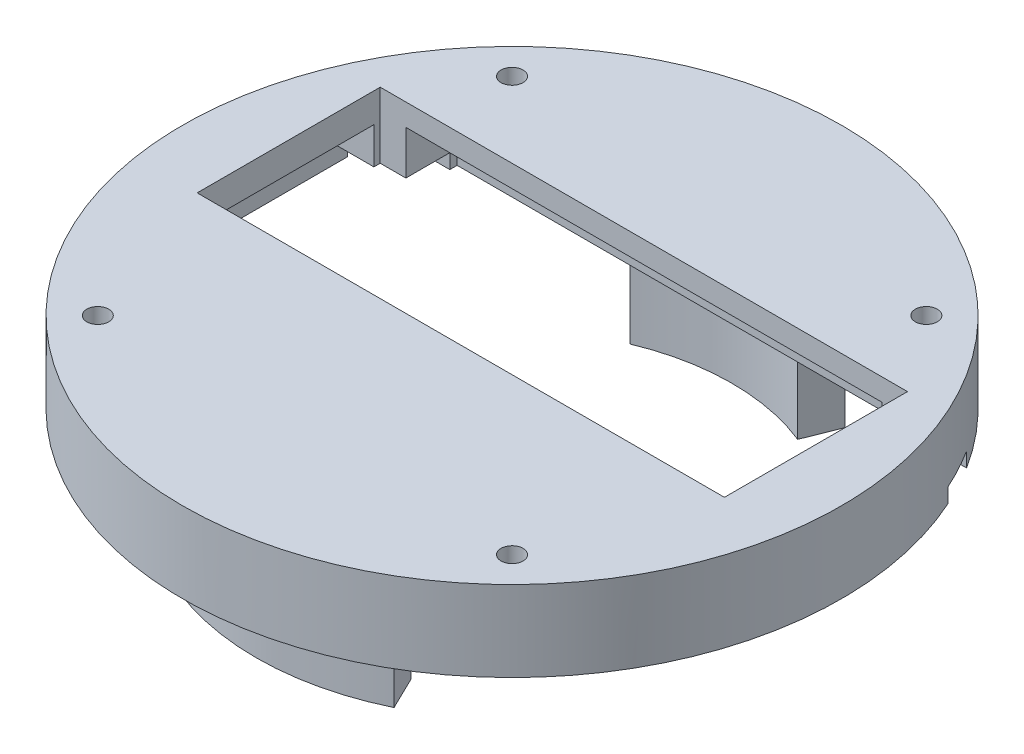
ISO-10303-21;
HEADER;
FILE_DESCRIPTION(('STEP AP214'),'2;1');
FILE_NAME('part.step','',(''),(''),'','','');
FILE_SCHEMA(('AUTOMOTIVE_DESIGN { 1 0 10303 214 1 1 1 1 }'));
ENDSEC;
DATA;
#1=APPLICATION_CONTEXT('core data for automotive mechanical design processes');
#2=APPLICATION_PROTOCOL_DEFINITION('international standard','automotive_design',2000,#1);
#3=PRODUCT_CONTEXT('',#1,'mechanical');
#4=PRODUCT('Part','Part','',(#3));
#5=PRODUCT_RELATED_PRODUCT_CATEGORY('part','',(#4));
#6=PRODUCT_DEFINITION_FORMATION('','',#4);
#7=PRODUCT_DEFINITION_CONTEXT('part definition',#1,'design');
#8=PRODUCT_DEFINITION('design','',#6,#7);
#9=PRODUCT_DEFINITION_SHAPE('','',#8);
#10=(LENGTH_UNIT() NAMED_UNIT(*) SI_UNIT(.MILLI.,.METRE.));
#11=(NAMED_UNIT(*) PLANE_ANGLE_UNIT() SI_UNIT($,.RADIAN.));
#12=(NAMED_UNIT(*) SI_UNIT($,.STERADIAN.) SOLID_ANGLE_UNIT());
#13=UNCERTAINTY_MEASURE_WITH_UNIT(LENGTH_MEASURE(1.E-05),#10,'distance_accuracy_value','');
#14=(GEOMETRIC_REPRESENTATION_CONTEXT(3) GLOBAL_UNCERTAINTY_ASSIGNED_CONTEXT((#13)) GLOBAL_UNIT_ASSIGNED_CONTEXT((#10,
#11,#12)) REPRESENTATION_CONTEXT('',''));
#15=CARTESIAN_POINT('',(0.,0.,0.));
#16=DIRECTION('',(0.,0.,1.));
#17=DIRECTION('',(1.,0.,0.));
#18=AXIS2_PLACEMENT_3D('',#15,#16,#17);
#19=CARTESIAN_POINT('',(-38.0657326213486,2.,-24.));
#20=DIRECTION('',(0.,0.,-1.));
#21=DIRECTION('',(-1.,0.,0.));
#22=AXIS2_PLACEMENT_3D('',#19,#20,#21);
#23=PLANE('',#22);
#24=DIRECTION('',(1.,0.,0.));
#25=VECTOR('',#24,1.);
#26=CARTESIAN_POINT('',(-38.0657326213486,0.,-24.));
#27=LINE('',#26,#25);
#28=CARTESIAN_POINT('',(-38.0657326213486,0.,-24.));
#29=VERTEX_POINT('',#28);
#30=CARTESIAN_POINT('',(-32.5,0.,-24.));
#31=VERTEX_POINT('',#30);
#32=EDGE_CURVE('E513',#29,#31,#27,.T.);
#33=ORIENTED_EDGE('',*,*,#32,.T.);
#34=DIRECTION('',(0.,1.,0.));
#35=VECTOR('',#34,1.);
#36=CARTESIAN_POINT('',(-32.5,2.,-24.));
#37=LINE('',#36,#35);
#38=CARTESIAN_POINT('',(-32.5,2.,-24.));
#39=VERTEX_POINT('',#38);
#40=EDGE_CURVE('E325',#31,#39,#37,.T.);
#41=ORIENTED_EDGE('',*,*,#40,.T.);
#42=DIRECTION('',(1.,0.,0.));
#43=VECTOR('',#42,1.);
#44=CARTESIAN_POINT('',(-38.0657326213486,2.,-24.));
#45=LINE('',#44,#43);
#46=CARTESIAN_POINT('',(-38.0657326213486,2.,-24.));
#47=VERTEX_POINT('',#46);
#48=EDGE_CURVE('E525',#47,#39,#45,.T.);
#49=ORIENTED_EDGE('',*,*,#48,.F.);
#50=DIRECTION('',(0.,-1.,0.));
#51=VECTOR('',#50,1.);
#52=CARTESIAN_POINT('',(-38.0657326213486,2.,-24.));
#53=LINE('',#52,#51);
#54=EDGE_CURVE('E548',#47,#29,#53,.T.);
#55=ORIENTED_EDGE('',*,*,#54,.T.);
#56=EDGE_LOOP('',(#33,#41,#49,#55));
#57=FACE_BOUND('',#56,.T.);
#58=ADVANCED_FACE('F34',(#57),#23,.F.);
#59=CARTESIAN_POINT('',(-41.,2.,13.));
#60=DIRECTION('',(0.,0.,1.));
#61=DIRECTION('',(1.,0.,0.));
#62=AXIS2_PLACEMENT_3D('',#59,#60,#61);
#63=PLANE('',#62);
#64=DIRECTION('',(-1.,0.,0.));
#65=VECTOR('',#64,1.);
#66=CARTESIAN_POINT('',(-41.,2.,13.));
#67=LINE('',#66,#65);
#68=CARTESIAN_POINT('',(-32.5,2.,13.));
#69=VERTEX_POINT('',#68);
#70=CARTESIAN_POINT('',(-41.,2.,13.));
#71=VERTEX_POINT('',#70);
#72=EDGE_CURVE('E512',#69,#71,#67,.T.);
#73=ORIENTED_EDGE('',*,*,#72,.F.);
#74=DIRECTION('',(0.,-1.,0.));
#75=VECTOR('',#74,1.);
#76=CARTESIAN_POINT('',(-32.5,2.,13.));
#77=LINE('',#76,#75);
#78=CARTESIAN_POINT('',(-32.5,0.,13.));
#79=VERTEX_POINT('',#78);
#80=EDGE_CURVE('E332',#69,#79,#77,.T.);
#81=ORIENTED_EDGE('',*,*,#80,.T.);
#82=DIRECTION('',(-1.,0.,0.));
#83=VECTOR('',#82,1.);
#84=CARTESIAN_POINT('',(-41.,0.,13.));
#85=LINE('',#84,#83);
#86=CARTESIAN_POINT('',(-41.,0.,13.));
#87=VERTEX_POINT('',#86);
#88=EDGE_CURVE('E533',#79,#87,#85,.T.);
#89=ORIENTED_EDGE('',*,*,#88,.T.);
#90=DIRECTION('',(0.,-1.,0.));
#91=VECTOR('',#90,1.);
#92=CARTESIAN_POINT('',(-41.,2.,13.));
#93=LINE('',#92,#91);
#94=EDGE_CURVE('E553',#71,#87,#93,.T.);
#95=ORIENTED_EDGE('',*,*,#94,.F.);
#96=EDGE_LOOP('',(#73,#81,#89,#95));
#97=FACE_BOUND('',#96,.T.);
#98=ADVANCED_FACE('F679',(#97),#63,.F.);
#99=CARTESIAN_POINT('',(0.,2.,0.));
#100=DIRECTION('',(0.,-1.,0.));
#101=DIRECTION('',(0.,0.,-1.));
#102=AXIS2_PLACEMENT_3D('',#99,#100,#101);
#103=PLANE('',#102);
#104=DIRECTION('',(0.,0.,-1.));
#105=VECTOR('',#104,1.);
#106=CARTESIAN_POINT('',(-32.5,2.,0.));
#107=LINE('',#106,#105);
#108=CARTESIAN_POINT('',(-32.5,2.,-18.));
#109=VERTEX_POINT('',#108);
#110=EDGE_CURVE('E323',#109,#39,#107,.T.);
#111=ORIENTED_EDGE('',*,*,#110,.F.);
#112=DIRECTION('',(1.,0.,0.));
#113=VECTOR('',#112,1.);
#114=CARTESIAN_POINT('',(36.,2.,-18.));
#115=LINE('',#114,#113);
#116=CARTESIAN_POINT('',(-36.,2.,-18.));
#117=VERTEX_POINT('',#116);
#118=EDGE_CURVE('E491',#117,#109,#115,.T.);
#119=ORIENTED_EDGE('',*,*,#118,.F.);
#120=DIRECTION('',(0.,0.,-1.));
#121=VECTOR('',#120,1.);
#122=CARTESIAN_POINT('',(-36.,2.,-18.));
#123=LINE('',#122,#121);
#124=CARTESIAN_POINT('',(-36.,2.,-17.1380929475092));
#125=VERTEX_POINT('',#124);
#126=EDGE_CURVE('E474',#125,#117,#123,.T.);
#127=ORIENTED_EDGE('',*,*,#126,.F.);
#128=DIRECTION('',(1.,0.,0.));
#129=VECTOR('',#128,1.);
#130=CARTESIAN_POINT('',(-36.,2.,-17.1380929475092));
#131=LINE('',#130,#129);
#132=CARTESIAN_POINT('',(-41.,2.,-17.1380929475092));
#133=VERTEX_POINT('',#132);
#134=EDGE_CURVE('E439',#133,#125,#131,.T.);
#135=ORIENTED_EDGE('',*,*,#134,.F.);
#136=DIRECTION('',(0.,0.,-1.));
#137=VECTOR('',#136,1.);
#138=CARTESIAN_POINT('',(-41.,2.,-18.5472369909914));
#139=LINE('',#138,#137);
#140=CARTESIAN_POINT('',(-41.,2.,-18.5472369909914));
#141=VERTEX_POINT('',#140);
#142=EDGE_CURVE('E517',#133,#141,#139,.T.);
#143=ORIENTED_EDGE('',*,*,#142,.T.);
#144=CARTESIAN_POINT('',(0.,2.,0.));
#145=DIRECTION('',(0.,-1.,0.));
#146=DIRECTION('',(0.,0.,-1.));
#147=AXIS2_PLACEMENT_3D('',#144,#145,#146);
#148=CIRCLE('',#147,45.);
#149=EDGE_CURVE('E521',#141,#47,#148,.T.);
#150=ORIENTED_EDGE('',*,*,#149,.T.);
#151=ORIENTED_EDGE('',*,*,#48,.T.);
#152=EDGE_LOOP('',(#111,#119,#127,#135,#143,#150,#151));
#153=FACE_BOUND('',#152,.T.);
#154=ADVANCED_FACE('F645',(#153),#103,.T.);
#155=CARTESIAN_POINT('',(-32.5,2.,6.99999999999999));
#156=VERTEX_POINT('',#155);
#157=EDGE_CURVE('E326',#69,#156,#107,.T.);
#158=ORIENTED_EDGE('',*,*,#157,.F.);
#159=ORIENTED_EDGE('',*,*,#72,.T.);
#160=CARTESIAN_POINT('',(-41.,2.,6.99999999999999));
#161=VERTEX_POINT('',#160);
#162=EDGE_CURVE('E518',#71,#161,#139,.T.);
#163=ORIENTED_EDGE('',*,*,#162,.T.);
#164=DIRECTION('',(-1.,0.,0.));
#165=VECTOR('',#164,1.);
#166=CARTESIAN_POINT('',(36.,2.,7.00000000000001));
#167=LINE('',#166,#165);
#168=EDGE_CURVE('E479',#156,#161,#167,.T.);
#169=ORIENTED_EDGE('',*,*,#168,.F.);
#170=EDGE_LOOP('',(#158,#159,#163,#169));
#171=FACE_BOUND('',#170,.T.);
#172=ADVANCED_FACE('F629',(#171),#103,.T.);
#173=CARTESIAN_POINT('',(-28.2842712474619,0.,-28.2842712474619));
#174=DIRECTION('',(0.,1.,0.));
#175=DIRECTION('',(0.,0.,1.));
#176=AXIS2_PLACEMENT_3D('',#173,#174,#175);
#177=CYLINDRICAL_SURFACE('',#176,1.5);
#178=CARTESIAN_POINT('',(-28.2842712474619,11.,-28.2842712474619));
#179=DIRECTION('',(0.,1.,0.));
#180=DIRECTION('',(0.,0.,1.));
#181=AXIS2_PLACEMENT_3D('',#178,#179,#180);
#182=CIRCLE('',#181,1.5);
#183=CARTESIAN_POINT('',(-28.2842712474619,11.,-26.7842712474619));
#184=VERTEX_POINT('',#183);
#185=EDGE_CURVE('E365',#184,#184,#182,.T.);
#186=ORIENTED_EDGE('',*,*,#185,.T.);
#187=EDGE_LOOP('',(#186));
#188=FACE_BOUND('',#187,.T.);
#189=CARTESIAN_POINT('',(-28.2842712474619,4.,-28.2842712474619));
#190=DIRECTION('',(0.,-1.,0.));
#191=DIRECTION('',(0.,0.,-1.));
#192=AXIS2_PLACEMENT_3D('',#189,#190,#191);
#193=CIRCLE('',#192,1.5);
#194=CARTESIAN_POINT('',(-28.2842712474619,4.,-29.7842712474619));
#195=VERTEX_POINT('',#194);
#196=EDGE_CURVE('E361',#195,#195,#193,.F.);
#197=ORIENTED_EDGE('',*,*,#196,.F.);
#198=EDGE_LOOP('',(#197));
#199=FACE_BOUND('',#198,.T.);
#200=ADVANCED_FACE('F740',(#188,#199),#177,.F.);
#201=CARTESIAN_POINT('',(28.2842712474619,0.,28.2842712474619));
#202=DIRECTION('',(0.,1.,0.));
#203=DIRECTION('',(0.,0.,1.));
#204=AXIS2_PLACEMENT_3D('',#201,#202,#203);
#205=CYLINDRICAL_SURFACE('',#204,1.5);
#206=CARTESIAN_POINT('',(28.2842712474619,11.,28.2842712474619));
#207=DIRECTION('',(0.,1.,0.));
#208=DIRECTION('',(0.,0.,1.));
#209=AXIS2_PLACEMENT_3D('',#206,#207,#208);
#210=CIRCLE('',#209,1.5);
#211=CARTESIAN_POINT('',(28.2842712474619,11.,29.7842712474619));
#212=VERTEX_POINT('',#211);
#213=EDGE_CURVE('E366',#212,#212,#210,.T.);
#214=ORIENTED_EDGE('',*,*,#213,.T.);
#215=EDGE_LOOP('',(#214));
#216=FACE_BOUND('',#215,.T.);
#217=CARTESIAN_POINT('',(28.2842712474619,4.,28.2842712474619));
#218=DIRECTION('',(0.,-1.,0.));
#219=DIRECTION('',(0.,0.,-1.));
#220=AXIS2_PLACEMENT_3D('',#217,#218,#219);
#221=CIRCLE('',#220,1.5);
#222=CARTESIAN_POINT('',(28.2842712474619,4.,26.7842712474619));
#223=VERTEX_POINT('',#222);
#224=EDGE_CURVE('E569',#223,#223,#221,.F.);
#225=ORIENTED_EDGE('',*,*,#224,.F.);
#226=EDGE_LOOP('',(#225));
#227=FACE_BOUND('',#226,.T.);
#228=ADVANCED_FACE('F737',(#216,#227),#205,.F.);
#229=CARTESIAN_POINT('',(28.2842712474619,0.,-28.2842712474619));
#230=DIRECTION('',(0.,1.,0.));
#231=DIRECTION('',(0.,0.,1.));
#232=AXIS2_PLACEMENT_3D('',#229,#230,#231);
#233=CYLINDRICAL_SURFACE('',#232,1.5);
#234=CARTESIAN_POINT('',(28.2842712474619,11.,-28.2842712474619));
#235=DIRECTION('',(0.,1.,0.));
#236=DIRECTION('',(0.,0.,1.));
#237=AXIS2_PLACEMENT_3D('',#234,#235,#236);
#238=CIRCLE('',#237,1.5);
#239=CARTESIAN_POINT('',(28.2842712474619,11.,-26.7842712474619));
#240=VERTEX_POINT('',#239);
#241=EDGE_CURVE('E362',#240,#240,#238,.T.);
#242=ORIENTED_EDGE('',*,*,#241,.T.);
#243=EDGE_LOOP('',(#242));
#244=FACE_BOUND('',#243,.T.);
#245=CARTESIAN_POINT('',(28.2842712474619,4.,-28.2842712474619));
#246=DIRECTION('',(0.,-1.,0.));
#247=DIRECTION('',(0.,0.,-1.));
#248=AXIS2_PLACEMENT_3D('',#245,#246,#247);
#249=CIRCLE('',#248,1.5);
#250=CARTESIAN_POINT('',(28.2842712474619,4.,-29.7842712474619));
#251=VERTEX_POINT('',#250);
#252=EDGE_CURVE('E339',#251,#251,#249,.F.);
#253=ORIENTED_EDGE('',*,*,#252,.F.);
#254=EDGE_LOOP('',(#253));
#255=FACE_BOUND('',#254,.T.);
#256=ADVANCED_FACE('F709',(#244,#255),#233,.F.);
#257=CARTESIAN_POINT('',(-28.2842712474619,0.,28.2842712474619));
#258=DIRECTION('',(0.,1.,0.));
#259=DIRECTION('',(0.,0.,1.));
#260=AXIS2_PLACEMENT_3D('',#257,#258,#259);
#261=CYLINDRICAL_SURFACE('',#260,1.5);
#262=CARTESIAN_POINT('',(-28.2842712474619,11.,28.2842712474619));
#263=DIRECTION('',(0.,1.,0.));
#264=DIRECTION('',(0.,0.,1.));
#265=AXIS2_PLACEMENT_3D('',#262,#263,#264);
#266=CIRCLE('',#265,1.5);
#267=CARTESIAN_POINT('',(-28.2842712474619,11.,29.7842712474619));
#268=VERTEX_POINT('',#267);
#269=EDGE_CURVE('E369',#268,#268,#266,.T.);
#270=ORIENTED_EDGE('',*,*,#269,.T.);
#271=EDGE_LOOP('',(#270));
#272=FACE_BOUND('',#271,.T.);
#273=CARTESIAN_POINT('',(-28.2842712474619,4.,28.2842712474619));
#274=DIRECTION('',(0.,-1.,0.));
#275=DIRECTION('',(0.,0.,-1.));
#276=AXIS2_PLACEMENT_3D('',#273,#274,#275);
#277=CIRCLE('',#276,1.5);
#278=CARTESIAN_POINT('',(-28.2842712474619,4.,26.7842712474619));
#279=VERTEX_POINT('',#278);
#280=EDGE_CURVE('E357',#279,#279,#277,.F.);
#281=ORIENTED_EDGE('',*,*,#280,.F.);
#282=EDGE_LOOP('',(#281));
#283=FACE_BOUND('',#282,.T.);
#284=ADVANCED_FACE('F702',(#272,#283),#261,.F.);
#285=CARTESIAN_POINT('',(0.,0.,0.));
#286=DIRECTION('',(0.,1.,0.));
#287=DIRECTION('',(0.,0.,1.));
#288=AXIS2_PLACEMENT_3D('',#285,#286,#287);
#289=PLANE('',#288);
#290=CARTESIAN_POINT('',(28.2842712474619,0.,28.2842712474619));
#291=DIRECTION('',(0.,-1.,0.));
#292=DIRECTION('',(0.,0.,-1.));
#293=AXIS2_PLACEMENT_3D('',#290,#291,#292);
#294=CIRCLE('',#293,2.5);
#295=CARTESIAN_POINT('',(28.2842712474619,0.,25.7842712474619));
#296=VERTEX_POINT('',#295);
#297=EDGE_CURVE('E340',#296,#296,#294,.T.);
#298=ORIENTED_EDGE('',*,*,#297,.F.);
#299=EDGE_LOOP('',(#298));
#300=FACE_BOUND('',#299,.T.);
#301=CARTESIAN_POINT('',(-28.2842712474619,0.,28.2842712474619));
#302=DIRECTION('',(0.,-1.,0.));
#303=DIRECTION('',(0.,0.,-1.));
#304=AXIS2_PLACEMENT_3D('',#301,#302,#303);
#305=CIRCLE('',#304,2.5);
#306=CARTESIAN_POINT('',(-28.2842712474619,0.,25.7842712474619));
#307=VERTEX_POINT('',#306);
#308=EDGE_CURVE('E358',#307,#307,#305,.T.);
#309=ORIENTED_EDGE('',*,*,#308,.F.);
#310=EDGE_LOOP('',(#309));
#311=FACE_BOUND('',#310,.T.);
#312=ORIENTED_EDGE('',*,*,#88,.F.);
#313=DIRECTION('',(0.,0.,-1.));
#314=VECTOR('',#313,1.);
#315=CARTESIAN_POINT('',(-32.5,0.,-25.));
#316=LINE('',#315,#314);
#317=CARTESIAN_POINT('',(-32.5,0.,25.));
#318=VERTEX_POINT('',#317);
#319=EDGE_CURVE('E290',#318,#79,#316,.T.);
#320=ORIENTED_EDGE('',*,*,#319,.F.);
#321=DIRECTION('',(-1.,0.,0.));
#322=VECTOR('',#321,1.);
#323=CARTESIAN_POINT('',(32.5,0.,25.));
#324=LINE('',#323,#322);
#325=CARTESIAN_POINT('',(32.5,0.,25.));
#326=VERTEX_POINT('',#325);
#327=EDGE_CURVE('E269',#326,#318,#324,.T.);
#328=ORIENTED_EDGE('',*,*,#327,.F.);
#329=DIRECTION('',(0.,0.,1.));
#330=VECTOR('',#329,1.);
#331=CARTESIAN_POINT('',(32.5,0.,-25.));
#332=LINE('',#331,#330);
#333=CARTESIAN_POINT('',(32.5,0.,13.));
#334=VERTEX_POINT('',#333);
#335=EDGE_CURVE('E294',#334,#326,#332,.T.);
#336=ORIENTED_EDGE('',*,*,#335,.F.);
#337=CARTESIAN_POINT('',(41.,0.,13.));
#338=VERTEX_POINT('',#337);
#339=EDGE_CURVE('E534',#338,#334,#85,.T.);
#340=ORIENTED_EDGE('',*,*,#339,.F.);
#341=DIRECTION('',(0.,0.,1.));
#342=VECTOR('',#341,1.);
#343=CARTESIAN_POINT('',(41.,0.,-18.5472369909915));
#344=LINE('',#343,#342);
#345=CARTESIAN_POINT('',(41.,0.,-18.5472369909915));
#346=VERTEX_POINT('',#345);
#347=EDGE_CURVE('E500',#346,#338,#344,.T.);
#348=ORIENTED_EDGE('',*,*,#347,.F.);
#349=CARTESIAN_POINT('',(0.,0.,0.));
#350=DIRECTION('',(0.,1.,0.));
#351=DIRECTION('',(0.,0.,1.));
#352=AXIS2_PLACEMENT_3D('',#349,#350,#351);
#353=CIRCLE('',#352,45.);
#354=CARTESIAN_POINT('',(-41.,0.,-18.5472369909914));
#355=VERTEX_POINT('',#354);
#356=EDGE_CURVE('E544',#355,#346,#353,.T.);
#357=ORIENTED_EDGE('',*,*,#356,.F.);
#358=DIRECTION('',(0.,0.,-1.));
#359=VECTOR('',#358,1.);
#360=CARTESIAN_POINT('',(-41.,0.,-18.5472369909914));
#361=LINE('',#360,#359);
#362=EDGE_CURVE('E537',#87,#355,#361,.T.);
#363=ORIENTED_EDGE('',*,*,#362,.F.);
#364=EDGE_LOOP('',(#312,#320,#328,#336,#340,#348,#357,#363));
#365=FACE_BOUND('',#364,.T.);
#366=CARTESIAN_POINT('',(0.,0.,0.));
#367=DIRECTION('',(0.,1.,0.));
#368=DIRECTION('',(0.,0.,-1.));
#369=AXIS2_PLACEMENT_3D('',#366,#367,#368);
#370=CIRCLE('',#369,30.);
#371=CARTESIAN_POINT('',(-13.1408420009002,0.,26.9688388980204));
#372=VERTEX_POINT('',#371);
#373=CARTESIAN_POINT('',(13.1408420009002,0.,26.9688388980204));
#374=VERTEX_POINT('',#373);
#375=EDGE_CURVE('E374',#372,#374,#370,.T.);
#376=ORIENTED_EDGE('',*,*,#375,.F.);
#377=DIRECTION('',(0.438028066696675,0.,-0.898961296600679));
#378=VECTOR('',#377,1.);
#379=CARTESIAN_POINT('',(-13.1408420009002,0.,26.9688388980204));
#380=LINE('',#379,#378);
#381=CARTESIAN_POINT('',(-15.3090809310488,0.,31.4186973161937));
#382=VERTEX_POINT('',#381);
#383=EDGE_CURVE('E379',#382,#372,#380,.T.);
#384=ORIENTED_EDGE('',*,*,#383,.F.);
#385=CARTESIAN_POINT('',(0.,0.,0.));
#386=DIRECTION('',(0.,-1.,0.));
#387=DIRECTION('',(0.,0.,-1.));
#388=AXIS2_PLACEMENT_3D('',#385,#386,#387);
#389=CIRCLE('',#388,34.95);
#390=CARTESIAN_POINT('',(15.3090809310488,0.,31.4186973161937));
#391=VERTEX_POINT('',#390);
#392=EDGE_CURVE('E391',#391,#382,#389,.T.);
#393=ORIENTED_EDGE('',*,*,#392,.F.);
#394=DIRECTION('',(0.438028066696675,0.,0.898961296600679));
#395=VECTOR('',#394,1.);
#396=CARTESIAN_POINT('',(15.3090809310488,0.,31.4186973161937));
#397=LINE('',#396,#395);
#398=EDGE_CURVE('E388',#374,#391,#397,.T.);
#399=ORIENTED_EDGE('',*,*,#398,.F.);
#400=EDGE_LOOP('',(#376,#384,#393,#399));
#401=FACE_BOUND('',#400,.T.);
#402=ADVANCED_FACE('F613',(#300,#311,#365,#401),#289,.F.);
#403=CARTESIAN_POINT('',(-28.2842712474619,0.,-28.2842712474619));
#404=DIRECTION('',(0.,-1.,0.));
#405=DIRECTION('',(0.,0.,-1.));
#406=AXIS2_PLACEMENT_3D('',#403,#404,#405);
#407=CIRCLE('',#406,2.5);
#408=CARTESIAN_POINT('',(-28.2842712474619,0.,-30.7842712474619));
#409=VERTEX_POINT('',#408);
#410=EDGE_CURVE('E346',#409,#409,#407,.T.);
#411=ORIENTED_EDGE('',*,*,#410,.F.);
#412=EDGE_LOOP('',(#411));
#413=FACE_BOUND('',#412,.T.);
#414=CARTESIAN_POINT('',(28.2842712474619,0.,-28.2842712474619));
#415=DIRECTION('',(0.,-1.,0.));
#416=DIRECTION('',(0.,0.,-1.));
#417=AXIS2_PLACEMENT_3D('',#414,#415,#416);
#418=CIRCLE('',#417,2.5);
#419=CARTESIAN_POINT('',(28.2842712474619,0.,-30.7842712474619));
#420=VERTEX_POINT('',#419);
#421=EDGE_CURVE('E335',#420,#420,#418,.T.);
#422=ORIENTED_EDGE('',*,*,#421,.F.);
#423=EDGE_LOOP('',(#422));
#424=FACE_BOUND('',#423,.T.);
#425=DIRECTION('',(1.,0.,0.));
#426=VECTOR('',#425,1.);
#427=CARTESIAN_POINT('',(32.5,0.,-25.));
#428=LINE('',#427,#426);
#429=CARTESIAN_POINT('',(-32.5,0.,-25.));
#430=VERTEX_POINT('',#429);
#431=CARTESIAN_POINT('',(32.5,0.,-25.));
#432=VERTEX_POINT('',#431);
#433=EDGE_CURVE('E292',#430,#432,#428,.T.);
#434=ORIENTED_EDGE('',*,*,#433,.F.);
#435=EDGE_CURVE('E275',#31,#430,#316,.T.);
#436=ORIENTED_EDGE('',*,*,#435,.F.);
#437=ORIENTED_EDGE('',*,*,#32,.F.);
#438=CARTESIAN_POINT('',(38.0657326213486,0.,-24.));
#439=VERTEX_POINT('',#438);
#440=EDGE_CURVE('E562',#439,#29,#353,.T.);
#441=ORIENTED_EDGE('',*,*,#440,.F.);
#442=CARTESIAN_POINT('',(32.5,0.,-24.));
#443=VERTEX_POINT('',#442);
#444=EDGE_CURVE('E539',#443,#439,#27,.T.);
#445=ORIENTED_EDGE('',*,*,#444,.F.);
#446=EDGE_CURVE('E295',#432,#443,#332,.T.);
#447=ORIENTED_EDGE('',*,*,#446,.F.);
#448=EDGE_LOOP('',(#434,#436,#437,#441,#445,#447));
#449=FACE_BOUND('',#448,.T.);
#450=CARTESIAN_POINT('',(0.,0.,0.));
#451=DIRECTION('',(0.,1.,0.));
#452=DIRECTION('',(0.,0.,-1.));
#453=AXIS2_PLACEMENT_3D('',#450,#451,#452);
#454=CIRCLE('',#453,30.);
#455=CARTESIAN_POINT('',(11.1507402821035,0.,-27.8506910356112));
#456=VERTEX_POINT('',#455);
#457=CARTESIAN_POINT('',(-11.5769317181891,0.,-27.6762470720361));
#458=VERTEX_POINT('',#457);
#459=EDGE_CURVE('E407',#456,#458,#454,.T.);
#460=ORIENTED_EDGE('',*,*,#459,.F.);
#461=DIRECTION('',(-0.371691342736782,0.,0.928356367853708));
#462=VECTOR('',#461,1.);
#463=CARTESIAN_POINT('',(11.1507402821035,0.,-27.8506910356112));
#464=LINE('',#463,#462);
#465=CARTESIAN_POINT('',(12.9906124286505,0.,-32.4460550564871));
#466=VERTEX_POINT('',#465);
#467=EDGE_CURVE('E411',#466,#456,#464,.T.);
#468=ORIENTED_EDGE('',*,*,#467,.F.);
#469=CARTESIAN_POINT('',(0.,0.,0.));
#470=DIRECTION('',(0.,-1.,0.));
#471=DIRECTION('',(0.,0.,-1.));
#472=AXIS2_PLACEMENT_3D('',#469,#470,#471);
#473=CIRCLE('',#472,34.95);
#474=CARTESIAN_POINT('',(-13.4871254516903,0.,-32.2428278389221));
#475=VERTEX_POINT('',#474);
#476=EDGE_CURVE('E423',#475,#466,#473,.T.);
#477=ORIENTED_EDGE('',*,*,#476,.F.);
#478=DIRECTION('',(-0.385897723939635,0.,-0.922541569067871));
#479=VECTOR('',#478,1.);
#480=CARTESIAN_POINT('',(-11.5769317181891,0.,-27.6762470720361));
#481=LINE('',#480,#479);
#482=EDGE_CURVE('E420',#458,#475,#481,.T.);
#483=ORIENTED_EDGE('',*,*,#482,.F.);
#484=EDGE_LOOP('',(#460,#468,#477,#483));
#485=FACE_BOUND('',#484,.T.);
#486=ADVANCED_FACE('F653',(#413,#424,#449,#485),#289,.F.);
#487=CARTESIAN_POINT('',(0.,11.,0.));
#488=DIRECTION('',(0.,-1.,0.));
#489=DIRECTION('',(0.,0.,-1.));
#490=AXIS2_PLACEMENT_3D('',#487,#488,#489);
#491=CYLINDRICAL_SURFACE('',#490,45.);
#492=ORIENTED_EDGE('',*,*,#356,.T.);
#493=DIRECTION('',(0.,-1.,0.));
#494=VECTOR('',#493,1.);
#495=CARTESIAN_POINT('',(41.,2.,-18.5472369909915));
#496=LINE('',#495,#494);
#497=CARTESIAN_POINT('',(41.,2.,-18.5472369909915));
#498=VERTEX_POINT('',#497);
#499=EDGE_CURVE('E542',#498,#346,#496,.T.);
#500=ORIENTED_EDGE('',*,*,#499,.F.);
#501=CARTESIAN_POINT('',(0.,2.,0.));
#502=DIRECTION('',(0.,-1.,0.));
#503=DIRECTION('',(0.,0.,1.));
#504=AXIS2_PLACEMENT_3D('',#501,#502,#503);
#505=CIRCLE('',#504,45.);
#506=CARTESIAN_POINT('',(38.0657326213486,2.,-24.));
#507=VERTEX_POINT('',#506);
#508=EDGE_CURVE('E528',#507,#498,#505,.T.);
#509=ORIENTED_EDGE('',*,*,#508,.F.);
#510=DIRECTION('',(0.,-1.,0.));
#511=VECTOR('',#510,1.);
#512=CARTESIAN_POINT('',(38.0657326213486,2.,-24.));
#513=LINE('',#512,#511);
#514=EDGE_CURVE('E545',#507,#439,#513,.T.);
#515=ORIENTED_EDGE('',*,*,#514,.T.);
#516=ORIENTED_EDGE('',*,*,#440,.T.);
#517=ORIENTED_EDGE('',*,*,#54,.F.);
#518=ORIENTED_EDGE('',*,*,#149,.F.);
#519=DIRECTION('',(0.,-1.,0.));
#520=VECTOR('',#519,1.);
#521=CARTESIAN_POINT('',(-41.,2.,-18.5472369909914));
#522=LINE('',#521,#520);
#523=EDGE_CURVE('E550',#141,#355,#522,.T.);
#524=ORIENTED_EDGE('',*,*,#523,.T.);
#525=EDGE_LOOP('',(#492,#500,#509,#515,#516,#517,#518,#524));
#526=FACE_BOUND('',#525,.T.);
#527=CARTESIAN_POINT('',(0.,11.,0.));
#528=DIRECTION('',(0.,1.,0.));
#529=DIRECTION('',(0.,0.,1.));
#530=AXIS2_PLACEMENT_3D('',#527,#528,#529);
#531=CIRCLE('',#530,45.);
#532=CARTESIAN_POINT('',(0.,11.,45.));
#533=VERTEX_POINT('',#532);
#534=EDGE_CURVE('E558',#533,#533,#531,.T.);
#535=ORIENTED_EDGE('',*,*,#534,.F.);
#536=EDGE_LOOP('',(#535));
#537=FACE_BOUND('',#536,.T.);
#538=ADVANCED_FACE('F36',(#526,#537),#491,.T.);
#539=CARTESIAN_POINT('',(0.,11.,0.));
#540=DIRECTION('',(0.,1.,0.));
#541=DIRECTION('',(0.,0.,1.));
#542=AXIS2_PLACEMENT_3D('',#539,#540,#541);
#543=PLANE('',#542);
#544=ORIENTED_EDGE('',*,*,#241,.F.);
#545=EDGE_LOOP('',(#544));
#546=FACE_BOUND('',#545,.T.);
#547=ORIENTED_EDGE('',*,*,#213,.F.);
#548=EDGE_LOOP('',(#547));
#549=FACE_BOUND('',#548,.T.);
#550=ORIENTED_EDGE('',*,*,#269,.F.);
#551=EDGE_LOOP('',(#550));
#552=FACE_BOUND('',#551,.T.);
#553=ORIENTED_EDGE('',*,*,#185,.F.);
#554=EDGE_LOOP('',(#553));
#555=FACE_BOUND('',#554,.T.);
#556=DIRECTION('',(0.,0.,-1.));
#557=VECTOR('',#556,1.);
#558=CARTESIAN_POINT('',(-36.,11.,-18.));
#559=LINE('',#558,#557);
#560=CARTESIAN_POINT('',(-36.,11.,6.99999999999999));
#561=VERTEX_POINT('',#560);
#562=CARTESIAN_POINT('',(-36.,11.,-18.));
#563=VERTEX_POINT('',#562);
#564=EDGE_CURVE('E475',#561,#563,#559,.T.);
#565=ORIENTED_EDGE('',*,*,#564,.T.);
#566=DIRECTION('',(1.,0.,0.));
#567=VECTOR('',#566,1.);
#568=CARTESIAN_POINT('',(36.,11.,-18.));
#569=LINE('',#568,#567);
#570=CARTESIAN_POINT('',(36.,11.,-18.));
#571=VERTEX_POINT('',#570);
#572=EDGE_CURVE('E478',#563,#571,#569,.T.);
#573=ORIENTED_EDGE('',*,*,#572,.T.);
#574=DIRECTION('',(0.,0.,1.));
#575=VECTOR('',#574,1.);
#576=CARTESIAN_POINT('',(36.,11.,-18.));
#577=LINE('',#576,#575);
#578=CARTESIAN_POINT('',(36.,11.,7.00000000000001));
#579=VERTEX_POINT('',#578);
#580=EDGE_CURVE('E482',#571,#579,#577,.T.);
#581=ORIENTED_EDGE('',*,*,#580,.T.);
#582=DIRECTION('',(-1.,0.,0.));
#583=VECTOR('',#582,1.);
#584=CARTESIAN_POINT('',(36.,11.,7.00000000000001));
#585=LINE('',#584,#583);
#586=EDGE_CURVE('E485',#579,#561,#585,.T.);
#587=ORIENTED_EDGE('',*,*,#586,.T.);
#588=EDGE_LOOP('',(#565,#573,#581,#587));
#589=FACE_BOUND('',#588,.T.);
#590=ORIENTED_EDGE('',*,*,#534,.T.);
#591=EDGE_LOOP('',(#590));
#592=FACE_BOUND('',#591,.T.);
#593=ADVANCED_FACE('F593',(#546,#549,#552,#555,#589,#592),#543,.T.);
#594=CARTESIAN_POINT('',(41.,2.,-18.5472369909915));
#595=DIRECTION('',(1.,0.,0.));
#596=DIRECTION('',(0.,0.,-1.));
#597=AXIS2_PLACEMENT_3D('',#594,#595,#596);
#598=PLANE('',#597);
#599=ORIENTED_EDGE('',*,*,#347,.T.);
#600=DIRECTION('',(0.,-1.,0.));
#601=VECTOR('',#600,1.);
#602=CARTESIAN_POINT('',(41.,2.,13.));
#603=LINE('',#602,#601);
#604=CARTESIAN_POINT('',(41.,2.,13.));
#605=VERTEX_POINT('',#604);
#606=EDGE_CURVE('E531',#605,#338,#603,.T.);
#607=ORIENTED_EDGE('',*,*,#606,.F.);
#608=DIRECTION('',(0.,0.,1.));
#609=VECTOR('',#608,1.);
#610=CARTESIAN_POINT('',(41.,2.,-18.5472369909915));
#611=LINE('',#610,#609);
#612=EDGE_CURVE('E509',#498,#605,#611,.T.);
#613=ORIENTED_EDGE('',*,*,#612,.F.);
#614=ORIENTED_EDGE('',*,*,#499,.T.);
#615=EDGE_LOOP('',(#599,#607,#613,#614));
#616=FACE_BOUND('',#615,.T.);
#617=ADVANCED_FACE('F689',(#616),#598,.F.);
#618=CARTESIAN_POINT('',(32.5,2.,-24.));
#619=VERTEX_POINT('',#618);
#620=EDGE_CURVE('E524',#619,#507,#45,.T.);
#621=ORIENTED_EDGE('',*,*,#620,.F.);
#622=DIRECTION('',(0.,-1.,0.));
#623=VECTOR('',#622,1.);
#624=CARTESIAN_POINT('',(32.5,2.,-24.));
#625=LINE('',#624,#623);
#626=EDGE_CURVE('E318',#619,#443,#625,.T.);
#627=ORIENTED_EDGE('',*,*,#626,.T.);
#628=ORIENTED_EDGE('',*,*,#444,.T.);
#629=ORIENTED_EDGE('',*,*,#514,.F.);
#630=EDGE_LOOP('',(#621,#627,#628,#629));
#631=FACE_BOUND('',#630,.T.);
#632=ADVANCED_FACE('F663',(#631),#23,.F.);
#633=CARTESIAN_POINT('',(-41.,2.,-18.5472369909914));
#634=DIRECTION('',(-1.,0.,0.));
#635=DIRECTION('',(0.,0.,1.));
#636=AXIS2_PLACEMENT_3D('',#633,#634,#635);
#637=PLANE('',#636);
#638=ORIENTED_EDGE('',*,*,#362,.T.);
#639=ORIENTED_EDGE('',*,*,#523,.F.);
#640=ORIENTED_EDGE('',*,*,#142,.F.);
#641=DIRECTION('',(0.,-1.,0.));
#642=VECTOR('',#641,1.);
#643=CARTESIAN_POINT('',(-41.,7.,-17.1380929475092));
#644=LINE('',#643,#642);
#645=CARTESIAN_POINT('',(-41.,7.,-17.1380929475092));
#646=VERTEX_POINT('',#645);
#647=EDGE_CURVE('E457',#646,#133,#644,.T.);
#648=ORIENTED_EDGE('',*,*,#647,.F.);
#649=DIRECTION('',(0.,0.,-1.));
#650=VECTOR('',#649,1.);
#651=CARTESIAN_POINT('',(-41.,7.,6.99999999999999));
#652=LINE('',#651,#650);
#653=CARTESIAN_POINT('',(-41.,7.,6.99999999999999));
#654=VERTEX_POINT('',#653);
#655=EDGE_CURVE('E445',#654,#646,#652,.T.);
#656=ORIENTED_EDGE('',*,*,#655,.F.);
#657=DIRECTION('',(0.,-1.,0.));
#658=VECTOR('',#657,1.);
#659=CARTESIAN_POINT('',(-41.,7.,6.99999999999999));
#660=LINE('',#659,#658);
#661=EDGE_CURVE('E451',#654,#161,#660,.T.);
#662=ORIENTED_EDGE('',*,*,#661,.T.);
#663=ORIENTED_EDGE('',*,*,#162,.F.);
#664=ORIENTED_EDGE('',*,*,#94,.T.);
#665=EDGE_LOOP('',(#638,#639,#640,#648,#656,#662,#663,#664));
#666=FACE_BOUND('',#665,.T.);
#667=ADVANCED_FACE('F634',(#666),#637,.F.);
#668=ORIENTED_EDGE('',*,*,#339,.T.);
#669=DIRECTION('',(0.,1.,0.));
#670=VECTOR('',#669,1.);
#671=CARTESIAN_POINT('',(32.5,2.,13.));
#672=LINE('',#671,#670);
#673=CARTESIAN_POINT('',(32.5,2.,13.));
#674=VERTEX_POINT('',#673);
#675=EDGE_CURVE('E311',#334,#674,#672,.T.);
#676=ORIENTED_EDGE('',*,*,#675,.T.);
#677=EDGE_CURVE('E514',#605,#674,#67,.T.);
#678=ORIENTED_EDGE('',*,*,#677,.F.);
#679=ORIENTED_EDGE('',*,*,#606,.T.);
#680=EDGE_LOOP('',(#668,#676,#678,#679));
#681=FACE_BOUND('',#680,.T.);
#682=ADVANCED_FACE('F608',(#681),#63,.F.);
#683=DIRECTION('',(0.,0.,1.));
#684=VECTOR('',#683,1.);
#685=CARTESIAN_POINT('',(32.5,2.,0.));
#686=LINE('',#685,#684);
#687=CARTESIAN_POINT('',(32.5,2.,-18.));
#688=VERTEX_POINT('',#687);
#689=EDGE_CURVE('E312',#619,#688,#686,.T.);
#690=ORIENTED_EDGE('',*,*,#689,.F.);
#691=ORIENTED_EDGE('',*,*,#620,.T.);
#692=ORIENTED_EDGE('',*,*,#508,.T.);
#693=ORIENTED_EDGE('',*,*,#612,.T.);
#694=ORIENTED_EDGE('',*,*,#677,.T.);
#695=CARTESIAN_POINT('',(32.5,2.,12.));
#696=VERTEX_POINT('',#695);
#697=EDGE_CURVE('E309',#696,#674,#686,.T.);
#698=ORIENTED_EDGE('',*,*,#697,.F.);
#699=DIRECTION('',(-1.,0.,0.));
#700=VECTOR('',#699,1.);
#701=CARTESIAN_POINT('',(36.,2.,12.));
#702=LINE('',#701,#700);
#703=CARTESIAN_POINT('',(36.,2.,12.));
#704=VERTEX_POINT('',#703);
#705=EDGE_CURVE('E456',#704,#696,#702,.T.);
#706=ORIENTED_EDGE('',*,*,#705,.F.);
#707=DIRECTION('',(0.,0.,1.));
#708=VECTOR('',#707,1.);
#709=CARTESIAN_POINT('',(36.,2.,-18.));
#710=LINE('',#709,#708);
#711=CARTESIAN_POINT('',(36.,2.,-18.));
#712=VERTEX_POINT('',#711);
#713=EDGE_CURVE('E494',#712,#704,#710,.T.);
#714=ORIENTED_EDGE('',*,*,#713,.F.);
#715=EDGE_CURVE('E490',#688,#712,#115,.T.);
#716=ORIENTED_EDGE('',*,*,#715,.F.);
#717=EDGE_LOOP('',(#690,#691,#692,#693,#694,#698,#706,#714,#716));
#718=FACE_BOUND('',#717,.T.);
#719=ADVANCED_FACE('F603',(#718),#103,.T.);
#720=CARTESIAN_POINT('',(-36.,11.,-18.));
#721=DIRECTION('',(-1.,0.,0.));
#722=DIRECTION('',(0.,0.,1.));
#723=AXIS2_PLACEMENT_3D('',#720,#721,#722);
#724=PLANE('',#723);
#725=DIRECTION('',(0.,0.,1.));
#726=VECTOR('',#725,1.);
#727=CARTESIAN_POINT('',(-36.,7.,6.99999999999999));
#728=LINE('',#727,#726);
#729=CARTESIAN_POINT('',(-36.,7.,-17.1380929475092));
#730=VERTEX_POINT('',#729);
#731=CARTESIAN_POINT('',(-36.,7.,6.99999999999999));
#732=VERTEX_POINT('',#731);
#733=EDGE_CURVE('E440',#730,#732,#728,.T.);
#734=ORIENTED_EDGE('',*,*,#733,.F.);
#735=DIRECTION('',(0.,-1.,0.));
#736=VECTOR('',#735,1.);
#737=CARTESIAN_POINT('',(-36.,7.,-17.1380929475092));
#738=LINE('',#737,#736);
#739=EDGE_CURVE('E453',#730,#125,#738,.T.);
#740=ORIENTED_EDGE('',*,*,#739,.T.);
#741=ORIENTED_EDGE('',*,*,#126,.T.);
#742=DIRECTION('',(0.,-1.,0.));
#743=VECTOR('',#742,1.);
#744=CARTESIAN_POINT('',(-36.,11.,-18.));
#745=LINE('',#744,#743);
#746=EDGE_CURVE('E488',#563,#117,#745,.T.);
#747=ORIENTED_EDGE('',*,*,#746,.F.);
#748=ORIENTED_EDGE('',*,*,#564,.F.);
#749=DIRECTION('',(0.,-1.,0.));
#750=VECTOR('',#749,1.);
#751=CARTESIAN_POINT('',(-36.,11.,6.99999999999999));
#752=LINE('',#751,#750);
#753=EDGE_CURVE('E497',#561,#732,#752,.T.);
#754=ORIENTED_EDGE('',*,*,#753,.T.);
#755=EDGE_LOOP('',(#734,#740,#741,#747,#748,#754));
#756=FACE_BOUND('',#755,.T.);
#757=ADVANCED_FACE('F640',(#756),#724,.F.);
#758=CARTESIAN_POINT('',(36.,11.,7.00000000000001));
#759=DIRECTION('',(0.,0.,1.));
#760=DIRECTION('',(1.,0.,0.));
#761=AXIS2_PLACEMENT_3D('',#758,#759,#760);
#762=PLANE('',#761);
#763=DIRECTION('',(1.,0.,0.));
#764=VECTOR('',#763,1.);
#765=CARTESIAN_POINT('',(36.,8.,7.00000000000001));
#766=LINE('',#765,#764);
#767=CARTESIAN_POINT('',(-32.5,8.,7.));
#768=VERTEX_POINT('',#767);
#769=CARTESIAN_POINT('',(32.5,8.,7.));
#770=VERTEX_POINT('',#769);
#771=EDGE_CURVE('E321',#768,#770,#766,.T.);
#772=ORIENTED_EDGE('',*,*,#771,.F.);
#773=DIRECTION('',(0.,-1.,0.));
#774=VECTOR('',#773,1.);
#775=CARTESIAN_POINT('',(-32.5,11.,6.99999999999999));
#776=LINE('',#775,#774);
#777=EDGE_CURVE('E329',#768,#156,#776,.T.);
#778=ORIENTED_EDGE('',*,*,#777,.T.);
#779=ORIENTED_EDGE('',*,*,#168,.T.);
#780=ORIENTED_EDGE('',*,*,#661,.F.);
#781=DIRECTION('',(-1.,0.,0.));
#782=VECTOR('',#781,1.);
#783=CARTESIAN_POINT('',(-36.,7.,6.99999999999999));
#784=LINE('',#783,#782);
#785=EDGE_CURVE('E442',#732,#654,#784,.T.);
#786=ORIENTED_EDGE('',*,*,#785,.F.);
#787=ORIENTED_EDGE('',*,*,#753,.F.);
#788=ORIENTED_EDGE('',*,*,#586,.F.);
#789=DIRECTION('',(0.,-1.,0.));
#790=VECTOR('',#789,1.);
#791=CARTESIAN_POINT('',(36.,11.,7.00000000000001));
#792=LINE('',#791,#790);
#793=CARTESIAN_POINT('',(36.,7.,7.00000000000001));
#794=VERTEX_POINT('',#793);
#795=EDGE_CURVE('E501',#579,#794,#792,.T.);
#796=ORIENTED_EDGE('',*,*,#795,.T.);
#797=DIRECTION('',(1.,0.,0.));
#798=VECTOR('',#797,1.);
#799=CARTESIAN_POINT('',(36.,7.,7.00000000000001));
#800=LINE('',#799,#798);
#801=CARTESIAN_POINT('',(32.5,7.,7.00000000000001));
#802=VERTEX_POINT('',#801);
#803=EDGE_CURVE('E467',#802,#794,#800,.T.);
#804=ORIENTED_EDGE('',*,*,#803,.F.);
#805=DIRECTION('',(0.,1.,0.));
#806=VECTOR('',#805,1.);
#807=CARTESIAN_POINT('',(32.5,11.,7.00000000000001));
#808=LINE('',#807,#806);
#809=EDGE_CURVE('E57',#802,#770,#808,.T.);
#810=ORIENTED_EDGE('',*,*,#809,.T.);
#811=EDGE_LOOP('',(#772,#778,#779,#780,#786,#787,#788,#796,#804,#810));
#812=FACE_BOUND('',#811,.T.);
#813=ADVANCED_FACE('F589',(#812),#762,.F.);
#814=CARTESIAN_POINT('',(36.,11.,-18.));
#815=DIRECTION('',(1.,0.,0.));
#816=DIRECTION('',(0.,0.,-1.));
#817=AXIS2_PLACEMENT_3D('',#814,#815,#816);
#818=PLANE('',#817);
#819=ORIENTED_EDGE('',*,*,#713,.T.);
#820=DIRECTION('',(0.,-1.,0.));
#821=VECTOR('',#820,1.);
#822=CARTESIAN_POINT('',(36.,7.,12.));
#823=LINE('',#822,#821);
#824=CARTESIAN_POINT('',(36.,7.,12.));
#825=VERTEX_POINT('',#824);
#826=EDGE_CURVE('E469',#825,#704,#823,.T.);
#827=ORIENTED_EDGE('',*,*,#826,.F.);
#828=DIRECTION('',(0.,0.,1.));
#829=VECTOR('',#828,1.);
#830=CARTESIAN_POINT('',(36.,7.,7.00000000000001));
#831=LINE('',#830,#829);
#832=EDGE_CURVE('E461',#794,#825,#831,.T.);
#833=ORIENTED_EDGE('',*,*,#832,.F.);
#834=ORIENTED_EDGE('',*,*,#795,.F.);
#835=ORIENTED_EDGE('',*,*,#580,.F.);
#836=DIRECTION('',(0.,-1.,0.));
#837=VECTOR('',#836,1.);
#838=CARTESIAN_POINT('',(36.,11.,-18.));
#839=LINE('',#838,#837);
#840=EDGE_CURVE('E504',#571,#712,#839,.T.);
#841=ORIENTED_EDGE('',*,*,#840,.T.);
#842=EDGE_LOOP('',(#819,#827,#833,#834,#835,#841));
#843=FACE_BOUND('',#842,.T.);
#844=ADVANCED_FACE('F585',(#843),#818,.F.);
#845=CARTESIAN_POINT('',(36.,11.,-18.));
#846=DIRECTION('',(0.,0.,-1.));
#847=DIRECTION('',(-1.,0.,0.));
#848=AXIS2_PLACEMENT_3D('',#845,#846,#847);
#849=PLANE('',#848);
#850=ORIENTED_EDGE('',*,*,#118,.T.);
#851=DIRECTION('',(0.,1.,0.));
#852=VECTOR('',#851,1.);
#853=CARTESIAN_POINT('',(-32.5,11.,-18.));
#854=LINE('',#853,#852);
#855=CARTESIAN_POINT('',(-32.5,8.,-18.));
#856=VERTEX_POINT('',#855);
#857=EDGE_CURVE('E11',#109,#856,#854,.T.);
#858=ORIENTED_EDGE('',*,*,#857,.T.);
#859=DIRECTION('',(-1.,0.,0.));
#860=VECTOR('',#859,1.);
#861=CARTESIAN_POINT('',(36.,8.,-18.));
#862=LINE('',#861,#860);
#863=CARTESIAN_POINT('',(32.5,8.,-18.));
#864=VERTEX_POINT('',#863);
#865=EDGE_CURVE('E42',#864,#856,#862,.T.);
#866=ORIENTED_EDGE('',*,*,#865,.F.);
#867=DIRECTION('',(0.,-1.,0.));
#868=VECTOR('',#867,1.);
#869=CARTESIAN_POINT('',(32.5,11.,-18.));
#870=LINE('',#869,#868);
#871=EDGE_CURVE('E315',#864,#688,#870,.T.);
#872=ORIENTED_EDGE('',*,*,#871,.T.);
#873=ORIENTED_EDGE('',*,*,#715,.T.);
#874=ORIENTED_EDGE('',*,*,#840,.F.);
#875=ORIENTED_EDGE('',*,*,#572,.F.);
#876=ORIENTED_EDGE('',*,*,#746,.T.);
#877=EDGE_LOOP('',(#850,#858,#866,#872,#873,#874,#875,#876));
#878=FACE_BOUND('',#877,.T.);
#879=ADVANCED_FACE('F599',(#878),#849,.F.);
#880=CARTESIAN_POINT('',(36.,7.,12.));
#881=DIRECTION('',(0.,0.,1.));
#882=DIRECTION('',(1.,0.,0.));
#883=AXIS2_PLACEMENT_3D('',#880,#881,#882);
#884=PLANE('',#883);
#885=ORIENTED_EDGE('',*,*,#705,.T.);
#886=DIRECTION('',(0.,1.,0.));
#887=VECTOR('',#886,1.);
#888=CARTESIAN_POINT('',(32.5,7.,12.));
#889=LINE('',#888,#887);
#890=CARTESIAN_POINT('',(32.5,7.,12.));
#891=VERTEX_POINT('',#890);
#892=EDGE_CURVE('E301',#696,#891,#889,.T.);
#893=ORIENTED_EDGE('',*,*,#892,.T.);
#894=DIRECTION('',(-1.,0.,0.));
#895=VECTOR('',#894,1.);
#896=CARTESIAN_POINT('',(36.,7.,12.));
#897=LINE('',#896,#895);
#898=EDGE_CURVE('E464',#825,#891,#897,.T.);
#899=ORIENTED_EDGE('',*,*,#898,.F.);
#900=ORIENTED_EDGE('',*,*,#826,.T.);
#901=EDGE_LOOP('',(#885,#893,#899,#900));
#902=FACE_BOUND('',#901,.T.);
#903=ADVANCED_FACE('F580',(#902),#884,.F.);
#904=CARTESIAN_POINT('',(0.,7.,0.));
#905=DIRECTION('',(0.,-1.,0.));
#906=DIRECTION('',(0.,0.,-1.));
#907=AXIS2_PLACEMENT_3D('',#904,#905,#906);
#908=PLANE('',#907);
#909=DIRECTION('',(0.,0.,1.));
#910=VECTOR('',#909,1.);
#911=CARTESIAN_POINT('',(32.5,7.,0.));
#912=LINE('',#911,#910);
#913=EDGE_CURVE('E561',#802,#891,#912,.T.);
#914=ORIENTED_EDGE('',*,*,#913,.F.);
#915=ORIENTED_EDGE('',*,*,#803,.T.);
#916=ORIENTED_EDGE('',*,*,#832,.T.);
#917=ORIENTED_EDGE('',*,*,#898,.T.);
#918=EDGE_LOOP('',(#914,#915,#916,#917));
#919=FACE_BOUND('',#918,.T.);
#920=ADVANCED_FACE('F582',(#919),#908,.T.);
#921=CARTESIAN_POINT('',(-36.,7.,-17.1380929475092));
#922=DIRECTION('',(0.,0.,-1.));
#923=DIRECTION('',(-1.,0.,0.));
#924=AXIS2_PLACEMENT_3D('',#921,#922,#923);
#925=PLANE('',#924);
#926=ORIENTED_EDGE('',*,*,#134,.T.);
#927=ORIENTED_EDGE('',*,*,#739,.F.);
#928=DIRECTION('',(1.,0.,0.));
#929=VECTOR('',#928,1.);
#930=CARTESIAN_POINT('',(-36.,7.,-17.1380929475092));
#931=LINE('',#930,#929);
#932=EDGE_CURVE('E448',#646,#730,#931,.T.);
#933=ORIENTED_EDGE('',*,*,#932,.F.);
#934=ORIENTED_EDGE('',*,*,#647,.T.);
#935=EDGE_LOOP('',(#926,#927,#933,#934));
#936=FACE_BOUND('',#935,.T.);
#937=ADVANCED_FACE('F788',(#936),#925,.F.);
#938=CARTESIAN_POINT('',(0.,7.,0.));
#939=DIRECTION('',(0.,1.,0.));
#940=DIRECTION('',(0.,0.,1.));
#941=AXIS2_PLACEMENT_3D('',#938,#939,#940);
#942=PLANE('',#941);
#943=ORIENTED_EDGE('',*,*,#733,.T.);
#944=ORIENTED_EDGE('',*,*,#785,.T.);
#945=ORIENTED_EDGE('',*,*,#655,.T.);
#946=ORIENTED_EDGE('',*,*,#932,.T.);
#947=EDGE_LOOP('',(#943,#944,#945,#946));
#948=FACE_BOUND('',#947,.T.);
#949=ADVANCED_FACE('F784',(#948),#942,.F.);
#950=CARTESIAN_POINT('',(0.,-12.,0.));
#951=DIRECTION('',(0.,1.,0.));
#952=DIRECTION('',(0.,0.,1.));
#953=AXIS2_PLACEMENT_3D('',#950,#951,#952);
#954=CYLINDRICAL_SURFACE('',#953,30.);
#955=ORIENTED_EDGE('',*,*,#459,.T.);
#956=DIRECTION('',(0.,1.,0.));
#957=VECTOR('',#956,1.);
#958=CARTESIAN_POINT('',(-11.5769317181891,-12.,-27.6762470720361));
#959=LINE('',#958,#957);
#960=CARTESIAN_POINT('',(-11.5769317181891,-12.,-27.6762470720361));
#961=VERTEX_POINT('',#960);
#962=EDGE_CURVE('E436',#961,#458,#959,.T.);
#963=ORIENTED_EDGE('',*,*,#962,.F.);
#964=CARTESIAN_POINT('',(0.,-12.,0.));
#965=DIRECTION('',(0.,1.,0.));
#966=DIRECTION('',(0.,0.,-1.));
#967=AXIS2_PLACEMENT_3D('',#964,#965,#966);
#968=CIRCLE('',#967,30.);
#969=CARTESIAN_POINT('',(11.1507402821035,-12.,-27.8506910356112));
#970=VERTEX_POINT('',#969);
#971=EDGE_CURVE('E408',#970,#961,#968,.T.);
#972=ORIENTED_EDGE('',*,*,#971,.F.);
#973=DIRECTION('',(0.,1.,0.));
#974=VECTOR('',#973,1.);
#975=CARTESIAN_POINT('',(11.1507402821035,-12.,-27.8506910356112));
#976=LINE('',#975,#974);
#977=EDGE_CURVE('E417',#970,#456,#976,.T.);
#978=ORIENTED_EDGE('',*,*,#977,.T.);
#979=EDGE_LOOP('',(#955,#963,#972,#978));
#980=FACE_BOUND('',#979,.T.);
#981=ADVANCED_FACE('F780',(#980),#954,.F.);
#982=CARTESIAN_POINT('',(-11.5769317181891,-12.,-27.6762470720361));
#983=DIRECTION('',(0.922541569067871,0.,-0.385897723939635));
#984=DIRECTION('',(-0.385897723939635,0.,-0.922541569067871));
#985=AXIS2_PLACEMENT_3D('',#982,#983,#984);
#986=PLANE('',#985);
#987=ORIENTED_EDGE('',*,*,#482,.T.);
#988=DIRECTION('',(0.,1.,0.));
#989=VECTOR('',#988,1.);
#990=CARTESIAN_POINT('',(-13.4871254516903,-12.,-32.2428278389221));
#991=LINE('',#990,#989);
#992=CARTESIAN_POINT('',(-13.4871254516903,-12.,-32.2428278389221));
#993=VERTEX_POINT('',#992);
#994=EDGE_CURVE('E433',#993,#475,#991,.T.);
#995=ORIENTED_EDGE('',*,*,#994,.F.);
#996=DIRECTION('',(-0.385897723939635,0.,-0.922541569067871));
#997=VECTOR('',#996,1.);
#998=CARTESIAN_POINT('',(-11.5769317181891,-12.,-27.6762470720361));
#999=LINE('',#998,#997);
#1000=EDGE_CURVE('E410',#961,#993,#999,.T.);
#1001=ORIENTED_EDGE('',*,*,#1000,.F.);
#1002=ORIENTED_EDGE('',*,*,#962,.T.);
#1003=EDGE_LOOP('',(#987,#995,#1001,#1002));
#1004=FACE_BOUND('',#1003,.T.);
#1005=ADVANCED_FACE('F776',(#1004),#986,.F.);
#1006=CARTESIAN_POINT('',(0.,-12.,0.));
#1007=DIRECTION('',(0.,1.,0.));
#1008=DIRECTION('',(0.,0.,1.));
#1009=AXIS2_PLACEMENT_3D('',#1006,#1007,#1008);
#1010=CYLINDRICAL_SURFACE('',#1009,34.95);
#1011=ORIENTED_EDGE('',*,*,#476,.T.);
#1012=DIRECTION('',(0.,1.,0.));
#1013=VECTOR('',#1012,1.);
#1014=CARTESIAN_POINT('',(12.9906124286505,-12.,-32.4460550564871));
#1015=LINE('',#1014,#1013);
#1016=CARTESIAN_POINT('',(12.9906124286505,-12.,-32.4460550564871));
#1017=VERTEX_POINT('',#1016);
#1018=EDGE_CURVE('E430',#1017,#466,#1015,.T.);
#1019=ORIENTED_EDGE('',*,*,#1018,.F.);
#1020=CARTESIAN_POINT('',(0.,-12.,0.));
#1021=DIRECTION('',(0.,-1.,0.));
#1022=DIRECTION('',(0.,0.,-1.));
#1023=AXIS2_PLACEMENT_3D('',#1020,#1021,#1022);
#1024=CIRCLE('',#1023,34.95);
#1025=EDGE_CURVE('E413',#993,#1017,#1024,.T.);
#1026=ORIENTED_EDGE('',*,*,#1025,.F.);
#1027=ORIENTED_EDGE('',*,*,#994,.T.);
#1028=EDGE_LOOP('',(#1011,#1019,#1026,#1027));
#1029=FACE_BOUND('',#1028,.T.);
#1030=ADVANCED_FACE('F772',(#1029),#1010,.T.);
#1031=CARTESIAN_POINT('',(11.1507402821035,-12.,-27.8506910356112));
#1032=DIRECTION('',(-0.928356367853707,0.,-0.371691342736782));
#1033=DIRECTION('',(-0.371691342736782,0.,0.928356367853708));
#1034=AXIS2_PLACEMENT_3D('',#1031,#1032,#1033);
#1035=PLANE('',#1034);
#1036=ORIENTED_EDGE('',*,*,#467,.T.);
#1037=ORIENTED_EDGE('',*,*,#977,.F.);
#1038=DIRECTION('',(-0.371691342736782,0.,0.928356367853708));
#1039=VECTOR('',#1038,1.);
#1040=CARTESIAN_POINT('',(11.1507402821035,-12.,-27.8506910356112));
#1041=LINE('',#1040,#1039);
#1042=EDGE_CURVE('E415',#1017,#970,#1041,.T.);
#1043=ORIENTED_EDGE('',*,*,#1042,.F.);
#1044=ORIENTED_EDGE('',*,*,#1018,.T.);
#1045=EDGE_LOOP('',(#1036,#1037,#1043,#1044));
#1046=FACE_BOUND('',#1045,.T.);
#1047=ADVANCED_FACE('F768',(#1046),#1035,.F.);
#1048=CARTESIAN_POINT('',(0.,-12.,0.));
#1049=DIRECTION('',(0.,-1.,0.));
#1050=DIRECTION('',(0.,0.,-1.));
#1051=AXIS2_PLACEMENT_3D('',#1048,#1049,#1050);
#1052=PLANE('',#1051);
#1053=ORIENTED_EDGE('',*,*,#971,.T.);
#1054=ORIENTED_EDGE('',*,*,#1000,.T.);
#1055=ORIENTED_EDGE('',*,*,#1025,.T.);
#1056=ORIENTED_EDGE('',*,*,#1042,.T.);
#1057=EDGE_LOOP('',(#1053,#1054,#1055,#1056));
#1058=FACE_BOUND('',#1057,.T.);
#1059=ADVANCED_FACE('F764',(#1058),#1052,.T.);
#1060=CARTESIAN_POINT('',(0.,-12.,0.));
#1061=DIRECTION('',(0.,1.,0.));
#1062=DIRECTION('',(0.,0.,1.));
#1063=AXIS2_PLACEMENT_3D('',#1060,#1061,#1062);
#1064=CYLINDRICAL_SURFACE('',#1063,30.);
#1065=ORIENTED_EDGE('',*,*,#375,.T.);
#1066=DIRECTION('',(0.,1.,0.));
#1067=VECTOR('',#1066,1.);
#1068=CARTESIAN_POINT('',(13.1408420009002,-12.,26.9688388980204));
#1069=LINE('',#1068,#1067);
#1070=CARTESIAN_POINT('',(13.1408420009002,-12.,26.9688388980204));
#1071=VERTEX_POINT('',#1070);
#1072=EDGE_CURVE('E404',#1071,#374,#1069,.T.);
#1073=ORIENTED_EDGE('',*,*,#1072,.F.);
#1074=CARTESIAN_POINT('',(0.,-12.,0.));
#1075=DIRECTION('',(0.,1.,0.));
#1076=DIRECTION('',(0.,0.,-1.));
#1077=AXIS2_PLACEMENT_3D('',#1074,#1075,#1076);
#1078=CIRCLE('',#1077,30.);
#1079=CARTESIAN_POINT('',(-13.1408420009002,-12.,26.9688388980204));
#1080=VERTEX_POINT('',#1079);
#1081=EDGE_CURVE('E375',#1080,#1071,#1078,.T.);
#1082=ORIENTED_EDGE('',*,*,#1081,.F.);
#1083=DIRECTION('',(0.,1.,0.));
#1084=VECTOR('',#1083,1.);
#1085=CARTESIAN_POINT('',(-13.1408420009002,-12.,26.9688388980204));
#1086=LINE('',#1085,#1084);
#1087=EDGE_CURVE('E385',#1080,#372,#1086,.T.);
#1088=ORIENTED_EDGE('',*,*,#1087,.T.);
#1089=EDGE_LOOP('',(#1065,#1073,#1082,#1088));
#1090=FACE_BOUND('',#1089,.T.);
#1091=ADVANCED_FACE('F760',(#1090),#1064,.F.);
#1092=CARTESIAN_POINT('',(15.3090809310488,-12.,31.4186973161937));
#1093=DIRECTION('',(-0.898961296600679,0.,0.438028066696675));
#1094=DIRECTION('',(0.438028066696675,0.,0.898961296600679));
#1095=AXIS2_PLACEMENT_3D('',#1092,#1093,#1094);
#1096=PLANE('',#1095);
#1097=ORIENTED_EDGE('',*,*,#398,.T.);
#1098=DIRECTION('',(0.,1.,0.));
#1099=VECTOR('',#1098,1.);
#1100=CARTESIAN_POINT('',(15.3090809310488,-12.,31.4186973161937));
#1101=LINE('',#1100,#1099);
#1102=CARTESIAN_POINT('',(15.3090809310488,-12.,31.4186973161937));
#1103=VERTEX_POINT('',#1102);
#1104=EDGE_CURVE('E401',#1103,#391,#1101,.T.);
#1105=ORIENTED_EDGE('',*,*,#1104,.F.);
#1106=DIRECTION('',(0.438028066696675,0.,0.898961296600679));
#1107=VECTOR('',#1106,1.);
#1108=CARTESIAN_POINT('',(15.3090809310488,-12.,31.4186973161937));
#1109=LINE('',#1108,#1107);
#1110=EDGE_CURVE('E378',#1071,#1103,#1109,.T.);
#1111=ORIENTED_EDGE('',*,*,#1110,.F.);
#1112=ORIENTED_EDGE('',*,*,#1072,.T.);
#1113=EDGE_LOOP('',(#1097,#1105,#1111,#1112));
#1114=FACE_BOUND('',#1113,.T.);
#1115=ADVANCED_FACE('F756',(#1114),#1096,.F.);
#1116=CARTESIAN_POINT('',(0.,-12.,0.));
#1117=DIRECTION('',(0.,1.,0.));
#1118=DIRECTION('',(0.,0.,1.));
#1119=AXIS2_PLACEMENT_3D('',#1116,#1117,#1118);
#1120=CYLINDRICAL_SURFACE('',#1119,34.95);
#1121=ORIENTED_EDGE('',*,*,#392,.T.);
#1122=DIRECTION('',(0.,1.,0.));
#1123=VECTOR('',#1122,1.);
#1124=CARTESIAN_POINT('',(-15.3090809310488,-12.,31.4186973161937));
#1125=LINE('',#1124,#1123);
#1126=CARTESIAN_POINT('',(-15.3090809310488,-12.,31.4186973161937));
#1127=VERTEX_POINT('',#1126);
#1128=EDGE_CURVE('E398',#1127,#382,#1125,.T.);
#1129=ORIENTED_EDGE('',*,*,#1128,.F.);
#1130=CARTESIAN_POINT('',(0.,-12.,0.));
#1131=DIRECTION('',(0.,-1.,0.));
#1132=DIRECTION('',(0.,0.,-1.));
#1133=AXIS2_PLACEMENT_3D('',#1130,#1131,#1132);
#1134=CIRCLE('',#1133,34.95);
#1135=EDGE_CURVE('E381',#1103,#1127,#1134,.T.);
#1136=ORIENTED_EDGE('',*,*,#1135,.F.);
#1137=ORIENTED_EDGE('',*,*,#1104,.T.);
#1138=EDGE_LOOP('',(#1121,#1129,#1136,#1137));
#1139=FACE_BOUND('',#1138,.T.);
#1140=ADVANCED_FACE('F752',(#1139),#1120,.T.);
#1141=CARTESIAN_POINT('',(-13.1408420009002,-12.,26.9688388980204));
#1142=DIRECTION('',(0.898961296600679,0.,0.438028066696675));
#1143=DIRECTION('',(0.438028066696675,0.,-0.898961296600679));
#1144=AXIS2_PLACEMENT_3D('',#1141,#1142,#1143);
#1145=PLANE('',#1144);
#1146=ORIENTED_EDGE('',*,*,#383,.T.);
#1147=ORIENTED_EDGE('',*,*,#1087,.F.);
#1148=DIRECTION('',(0.438028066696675,0.,-0.898961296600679));
#1149=VECTOR('',#1148,1.);
#1150=CARTESIAN_POINT('',(-13.1408420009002,-12.,26.9688388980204));
#1151=LINE('',#1150,#1149);
#1152=EDGE_CURVE('E383',#1127,#1080,#1151,.T.);
#1153=ORIENTED_EDGE('',*,*,#1152,.F.);
#1154=ORIENTED_EDGE('',*,*,#1128,.T.);
#1155=EDGE_LOOP('',(#1146,#1147,#1153,#1154));
#1156=FACE_BOUND('',#1155,.T.);
#1157=ADVANCED_FACE('F748',(#1156),#1145,.F.);
#1158=CARTESIAN_POINT('',(0.,-12.,0.));
#1159=DIRECTION('',(0.,-1.,0.));
#1160=DIRECTION('',(0.,0.,-1.));
#1161=AXIS2_PLACEMENT_3D('',#1158,#1159,#1160);
#1162=PLANE('',#1161);
#1163=ORIENTED_EDGE('',*,*,#1081,.T.);
#1164=ORIENTED_EDGE('',*,*,#1110,.T.);
#1165=ORIENTED_EDGE('',*,*,#1135,.T.);
#1166=ORIENTED_EDGE('',*,*,#1152,.T.);
#1167=EDGE_LOOP('',(#1163,#1164,#1165,#1166));
#1168=FACE_BOUND('',#1167,.T.);
#1169=ADVANCED_FACE('F729',(#1168),#1162,.T.);
#1170=CARTESIAN_POINT('',(-28.2842712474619,4.,28.2842712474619));
#1171=DIRECTION('',(0.,-1.,0.));
#1172=DIRECTION('',(0.,0.,-1.));
#1173=AXIS2_PLACEMENT_3D('',#1170,#1171,#1172);
#1174=PLANE('',#1173);
#1175=CARTESIAN_POINT('',(-28.2842712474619,4.,28.2842712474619));
#1176=DIRECTION('',(0.,-1.,0.));
#1177=DIRECTION('',(0.,0.,-1.));
#1178=AXIS2_PLACEMENT_3D('',#1175,#1176,#1177);
#1179=CIRCLE('',#1178,2.5);
#1180=CARTESIAN_POINT('',(-28.2842712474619,4.,25.7842712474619));
#1181=VERTEX_POINT('',#1180);
#1182=EDGE_CURVE('E354',#1181,#1181,#1179,.T.);
#1183=ORIENTED_EDGE('',*,*,#1182,.T.);
#1184=EDGE_LOOP('',(#1183));
#1185=FACE_BOUND('',#1184,.T.);
#1186=ORIENTED_EDGE('',*,*,#280,.T.);
#1187=EDGE_LOOP('',(#1186));
#1188=FACE_BOUND('',#1187,.T.);
#1189=ADVANCED_FACE('F719',(#1185,#1188),#1174,.T.);
#1190=CARTESIAN_POINT('',(-28.2842712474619,4.,28.2842712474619));
#1191=DIRECTION('',(0.,-1.,0.));
#1192=DIRECTION('',(0.,0.,-1.));
#1193=AXIS2_PLACEMENT_3D('',#1190,#1191,#1192);
#1194=CYLINDRICAL_SURFACE('',#1193,2.5);
#1195=ORIENTED_EDGE('',*,*,#1182,.F.);
#1196=EDGE_LOOP('',(#1195));
#1197=FACE_BOUND('',#1196,.T.);
#1198=ORIENTED_EDGE('',*,*,#308,.T.);
#1199=EDGE_LOOP('',(#1198));
#1200=FACE_BOUND('',#1199,.T.);
#1201=ADVANCED_FACE('F716',(#1197,#1200),#1194,.F.);
#1202=CARTESIAN_POINT('',(28.2842712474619,4.,-28.2842712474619));
#1203=DIRECTION('',(0.,-1.,0.));
#1204=DIRECTION('',(0.,0.,-1.));
#1205=AXIS2_PLACEMENT_3D('',#1202,#1203,#1204);
#1206=PLANE('',#1205);
#1207=CARTESIAN_POINT('',(28.2842712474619,4.,-28.2842712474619));
#1208=DIRECTION('',(0.,-1.,0.));
#1209=DIRECTION('',(0.,0.,-1.));
#1210=AXIS2_PLACEMENT_3D('',#1207,#1208,#1209);
#1211=CIRCLE('',#1210,2.5);
#1212=CARTESIAN_POINT('',(28.2842712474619,4.,-30.7842712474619));
#1213=VERTEX_POINT('',#1212);
#1214=EDGE_CURVE('E349',#1213,#1213,#1211,.T.);
#1215=ORIENTED_EDGE('',*,*,#1214,.T.);
#1216=EDGE_LOOP('',(#1215));
#1217=FACE_BOUND('',#1216,.T.);
#1218=ORIENTED_EDGE('',*,*,#252,.T.);
#1219=EDGE_LOOP('',(#1218));
#1220=FACE_BOUND('',#1219,.T.);
#1221=ADVANCED_FACE('F718',(#1217,#1220),#1206,.T.);
#1222=CARTESIAN_POINT('',(28.2842712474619,4.,-28.2842712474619));
#1223=DIRECTION('',(0.,-1.,0.));
#1224=DIRECTION('',(0.,0.,-1.));
#1225=AXIS2_PLACEMENT_3D('',#1222,#1223,#1224);
#1226=CYLINDRICAL_SURFACE('',#1225,2.5);
#1227=ORIENTED_EDGE('',*,*,#1214,.F.);
#1228=EDGE_LOOP('',(#1227));
#1229=FACE_BOUND('',#1228,.T.);
#1230=ORIENTED_EDGE('',*,*,#421,.T.);
#1231=EDGE_LOOP('',(#1230));
#1232=FACE_BOUND('',#1231,.T.);
#1233=ADVANCED_FACE('F726',(#1229,#1232),#1226,.F.);
#1234=CARTESIAN_POINT('',(28.2842712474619,4.,28.2842712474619));
#1235=DIRECTION('',(0.,-1.,0.));
#1236=DIRECTION('',(0.,0.,-1.));
#1237=AXIS2_PLACEMENT_3D('',#1234,#1235,#1236);
#1238=PLANE('',#1237);
#1239=CARTESIAN_POINT('',(28.2842712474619,4.,28.2842712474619));
#1240=DIRECTION('',(0.,-1.,0.));
#1241=DIRECTION('',(0.,0.,-1.));
#1242=AXIS2_PLACEMENT_3D('',#1239,#1240,#1241);
#1243=CIRCLE('',#1242,2.5);
#1244=CARTESIAN_POINT('',(28.2842712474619,4.,25.7842712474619));
#1245=VERTEX_POINT('',#1244);
#1246=EDGE_CURVE('E336',#1245,#1245,#1243,.T.);
#1247=ORIENTED_EDGE('',*,*,#1246,.T.);
#1248=EDGE_LOOP('',(#1247));
#1249=FACE_BOUND('',#1248,.T.);
#1250=ORIENTED_EDGE('',*,*,#224,.T.);
#1251=EDGE_LOOP('',(#1250));
#1252=FACE_BOUND('',#1251,.T.);
#1253=ADVANCED_FACE('F856',(#1249,#1252),#1238,.T.);
#1254=CARTESIAN_POINT('',(28.2842712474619,4.,28.2842712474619));
#1255=DIRECTION('',(0.,-1.,0.));
#1256=DIRECTION('',(0.,0.,-1.));
#1257=AXIS2_PLACEMENT_3D('',#1254,#1255,#1256);
#1258=CYLINDRICAL_SURFACE('',#1257,2.5);
#1259=ORIENTED_EDGE('',*,*,#1246,.F.);
#1260=EDGE_LOOP('',(#1259));
#1261=FACE_BOUND('',#1260,.T.);
#1262=ORIENTED_EDGE('',*,*,#297,.T.);
#1263=EDGE_LOOP('',(#1262));
#1264=FACE_BOUND('',#1263,.T.);
#1265=ADVANCED_FACE('F865',(#1261,#1264),#1258,.F.);
#1266=CARTESIAN_POINT('',(-28.2842712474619,4.,-28.2842712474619));
#1267=DIRECTION('',(0.,-1.,0.));
#1268=DIRECTION('',(0.,0.,-1.));
#1269=AXIS2_PLACEMENT_3D('',#1266,#1267,#1268);
#1270=PLANE('',#1269);
#1271=CARTESIAN_POINT('',(-28.2842712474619,4.,-28.2842712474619));
#1272=DIRECTION('',(0.,-1.,0.));
#1273=DIRECTION('',(0.,0.,-1.));
#1274=AXIS2_PLACEMENT_3D('',#1271,#1272,#1273);
#1275=CIRCLE('',#1274,2.5);
#1276=CARTESIAN_POINT('',(-28.2842712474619,4.,-30.7842712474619));
#1277=VERTEX_POINT('',#1276);
#1278=EDGE_CURVE('E343',#1277,#1277,#1275,.T.);
#1279=ORIENTED_EDGE('',*,*,#1278,.T.);
#1280=EDGE_LOOP('',(#1279));
#1281=FACE_BOUND('',#1280,.T.);
#1282=ORIENTED_EDGE('',*,*,#196,.T.);
#1283=EDGE_LOOP('',(#1282));
#1284=FACE_BOUND('',#1283,.T.);
#1285=ADVANCED_FACE('F875',(#1281,#1284),#1270,.T.);
#1286=CARTESIAN_POINT('',(-28.2842712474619,4.,-28.2842712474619));
#1287=DIRECTION('',(0.,-1.,0.));
#1288=DIRECTION('',(0.,0.,-1.));
#1289=AXIS2_PLACEMENT_3D('',#1286,#1287,#1288);
#1290=CYLINDRICAL_SURFACE('',#1289,2.5);
#1291=ORIENTED_EDGE('',*,*,#1278,.F.);
#1292=EDGE_LOOP('',(#1291));
#1293=FACE_BOUND('',#1292,.T.);
#1294=ORIENTED_EDGE('',*,*,#410,.T.);
#1295=EDGE_LOOP('',(#1294));
#1296=FACE_BOUND('',#1295,.T.);
#1297=ADVANCED_FACE('F677',(#1293,#1296),#1290,.F.);
#1298=CARTESIAN_POINT('',(32.5,8.,-25.));
#1299=DIRECTION('',(1.,0.,0.));
#1300=DIRECTION('',(0.,0.,-1.));
#1301=AXIS2_PLACEMENT_3D('',#1298,#1299,#1300);
#1302=PLANE('',#1301);
#1303=ORIENTED_EDGE('',*,*,#335,.T.);
#1304=DIRECTION('',(0.,-1.,0.));
#1305=VECTOR('',#1304,1.);
#1306=CARTESIAN_POINT('',(32.5,8.,25.));
#1307=LINE('',#1306,#1305);
#1308=CARTESIAN_POINT('',(32.5,8.,25.));
#1309=VERTEX_POINT('',#1308);
#1310=EDGE_CURVE('E302',#1309,#326,#1307,.T.);
#1311=ORIENTED_EDGE('',*,*,#1310,.F.);
#1312=DIRECTION('',(0.,0.,1.));
#1313=VECTOR('',#1312,1.);
#1314=CARTESIAN_POINT('',(32.5,8.,-25.));
#1315=LINE('',#1314,#1313);
#1316=EDGE_CURVE('E283',#770,#1309,#1315,.T.);
#1317=ORIENTED_EDGE('',*,*,#1316,.F.);
#1318=ORIENTED_EDGE('',*,*,#809,.F.);
#1319=ORIENTED_EDGE('',*,*,#913,.T.);
#1320=ORIENTED_EDGE('',*,*,#892,.F.);
#1321=ORIENTED_EDGE('',*,*,#697,.T.);
#1322=ORIENTED_EDGE('',*,*,#675,.F.);
#1323=EDGE_LOOP('',(#1303,#1311,#1317,#1318,#1319,#1320,#1321,#1322));
#1324=FACE_BOUND('',#1323,.T.);
#1325=ADVANCED_FACE('F574',(#1324),#1302,.F.);
#1326=CARTESIAN_POINT('',(0.,8.,0.));
#1327=DIRECTION('',(0.,-1.,0.));
#1328=DIRECTION('',(0.,0.,-1.));
#1329=AXIS2_PLACEMENT_3D('',#1326,#1327,#1328);
#1330=PLANE('',#1329);
#1331=ORIENTED_EDGE('',*,*,#771,.T.);
#1332=ORIENTED_EDGE('',*,*,#1316,.T.);
#1333=DIRECTION('',(-1.,0.,0.));
#1334=VECTOR('',#1333,1.);
#1335=CARTESIAN_POINT('',(32.5,8.,25.));
#1336=LINE('',#1335,#1334);
#1337=CARTESIAN_POINT('',(-32.5,8.,25.));
#1338=VERTEX_POINT('',#1337);
#1339=EDGE_CURVE('E280',#1309,#1338,#1336,.T.);
#1340=ORIENTED_EDGE('',*,*,#1339,.T.);
#1341=DIRECTION('',(0.,0.,-1.));
#1342=VECTOR('',#1341,1.);
#1343=CARTESIAN_POINT('',(-32.5,8.,-25.));
#1344=LINE('',#1343,#1342);
#1345=EDGE_CURVE('E268',#1338,#768,#1344,.T.);
#1346=ORIENTED_EDGE('',*,*,#1345,.T.);
#1347=EDGE_LOOP('',(#1331,#1332,#1340,#1346));
#1348=FACE_BOUND('',#1347,.T.);
#1349=ADVANCED_FACE('F624',(#1348),#1330,.T.);
#1350=CARTESIAN_POINT('',(-32.5,8.,-25.));
#1351=DIRECTION('',(-1.,0.,0.));
#1352=DIRECTION('',(0.,0.,1.));
#1353=AXIS2_PLACEMENT_3D('',#1350,#1351,#1352);
#1354=PLANE('',#1353);
#1355=ORIENTED_EDGE('',*,*,#157,.T.);
#1356=ORIENTED_EDGE('',*,*,#777,.F.);
#1357=ORIENTED_EDGE('',*,*,#1345,.F.);
#1358=DIRECTION('',(0.,-1.,0.));
#1359=VECTOR('',#1358,1.);
#1360=CARTESIAN_POINT('',(-32.5,8.,25.));
#1361=LINE('',#1360,#1359);
#1362=EDGE_CURVE('E299',#1338,#318,#1361,.T.);
#1363=ORIENTED_EDGE('',*,*,#1362,.T.);
#1364=ORIENTED_EDGE('',*,*,#319,.T.);
#1365=ORIENTED_EDGE('',*,*,#80,.F.);
#1366=EDGE_LOOP('',(#1355,#1356,#1357,#1363,#1364,#1365));
#1367=FACE_BOUND('',#1366,.T.);
#1368=ADVANCED_FACE('F926',(#1367),#1354,.F.);
#1369=CARTESIAN_POINT('',(32.5,8.,25.));
#1370=DIRECTION('',(0.,0.,1.));
#1371=DIRECTION('',(1.,0.,0.));
#1372=AXIS2_PLACEMENT_3D('',#1369,#1370,#1371);
#1373=PLANE('',#1372);
#1374=ORIENTED_EDGE('',*,*,#327,.T.);
#1375=ORIENTED_EDGE('',*,*,#1362,.F.);
#1376=ORIENTED_EDGE('',*,*,#1339,.F.);
#1377=ORIENTED_EDGE('',*,*,#1310,.T.);
#1378=EDGE_LOOP('',(#1374,#1375,#1376,#1377));
#1379=FACE_BOUND('',#1378,.T.);
#1380=ADVANCED_FACE('F621',(#1379),#1373,.F.);
#1381=ORIENTED_EDGE('',*,*,#435,.T.);
#1382=DIRECTION('',(0.,-1.,0.));
#1383=VECTOR('',#1382,1.);
#1384=CARTESIAN_POINT('',(-32.5,8.,-25.));
#1385=LINE('',#1384,#1383);
#1386=CARTESIAN_POINT('',(-32.5,8.,-25.));
#1387=VERTEX_POINT('',#1386);
#1388=EDGE_CURVE('E272',#1387,#430,#1385,.T.);
#1389=ORIENTED_EDGE('',*,*,#1388,.F.);
#1390=EDGE_CURVE('E261',#856,#1387,#1344,.T.);
#1391=ORIENTED_EDGE('',*,*,#1390,.F.);
#1392=ORIENTED_EDGE('',*,*,#857,.F.);
#1393=ORIENTED_EDGE('',*,*,#110,.T.);
#1394=ORIENTED_EDGE('',*,*,#40,.F.);
#1395=EDGE_LOOP('',(#1381,#1389,#1391,#1392,#1393,#1394));
#1396=FACE_BOUND('',#1395,.T.);
#1397=ADVANCED_FACE('F273',(#1396),#1354,.F.);
#1398=ORIENTED_EDGE('',*,*,#865,.T.);
#1399=ORIENTED_EDGE('',*,*,#1390,.T.);
#1400=DIRECTION('',(1.,0.,0.));
#1401=VECTOR('',#1400,1.);
#1402=CARTESIAN_POINT('',(32.5,8.,-25.));
#1403=LINE('',#1402,#1401);
#1404=CARTESIAN_POINT('',(32.5,8.,-25.));
#1405=VERTEX_POINT('',#1404);
#1406=EDGE_CURVE('E265',#1387,#1405,#1403,.T.);
#1407=ORIENTED_EDGE('',*,*,#1406,.T.);
#1408=EDGE_CURVE('E49',#1405,#864,#1315,.T.);
#1409=ORIENTED_EDGE('',*,*,#1408,.T.);
#1410=EDGE_LOOP('',(#1398,#1399,#1407,#1409));
#1411=FACE_BOUND('',#1410,.T.);
#1412=ADVANCED_FACE('F263',(#1411),#1330,.T.);
#1413=ORIENTED_EDGE('',*,*,#689,.T.);
#1414=ORIENTED_EDGE('',*,*,#871,.F.);
#1415=ORIENTED_EDGE('',*,*,#1408,.F.);
#1416=DIRECTION('',(0.,-1.,0.));
#1417=VECTOR('',#1416,1.);
#1418=CARTESIAN_POINT('',(32.5,8.,-25.));
#1419=LINE('',#1418,#1417);
#1420=EDGE_CURVE('E279',#1405,#432,#1419,.T.);
#1421=ORIENTED_EDGE('',*,*,#1420,.T.);
#1422=ORIENTED_EDGE('',*,*,#446,.T.);
#1423=ORIENTED_EDGE('',*,*,#626,.F.);
#1424=EDGE_LOOP('',(#1413,#1414,#1415,#1421,#1422,#1423));
#1425=FACE_BOUND('',#1424,.T.);
#1426=ADVANCED_FACE('F666',(#1425),#1302,.F.);
#1427=CARTESIAN_POINT('',(32.5,8.,-25.));
#1428=DIRECTION('',(0.,0.,-1.));
#1429=DIRECTION('',(-1.,0.,0.));
#1430=AXIS2_PLACEMENT_3D('',#1427,#1428,#1429);
#1431=PLANE('',#1430);
#1432=ORIENTED_EDGE('',*,*,#433,.T.);
#1433=ORIENTED_EDGE('',*,*,#1420,.F.);
#1434=ORIENTED_EDGE('',*,*,#1406,.F.);
#1435=ORIENTED_EDGE('',*,*,#1388,.T.);
#1436=EDGE_LOOP('',(#1432,#1433,#1434,#1435));
#1437=FACE_BOUND('',#1436,.T.);
#1438=ADVANCED_FACE('F282',(#1437),#1431,.F.);
#1439=CLOSED_SHELL('',(#58,#98,#154,#172,#200,#228,#256,#284,#402,#486,#538,#593,#617,#632,#667,
#682,#719,#757,#813,#844,#879,#903,#920,#937,#949,#981,#1005,#1030,#1047,#1059,#1091,#1115,
#1140,#1157,#1169,#1189,#1201,#1221,#1233,#1253,#1265,#1285,#1297,#1325,#1349,#1368,#1380,#1397,
#1412,#1426,#1438));
#1440=MANIFOLD_SOLID_BREP('B2',#1439);
#1441=ADVANCED_BREP_SHAPE_REPRESENTATION('',(#18,#1440),#14);
#1442=SHAPE_DEFINITION_REPRESENTATION(#9,#1441);
ENDSEC;
END-ISO-10303-21;
